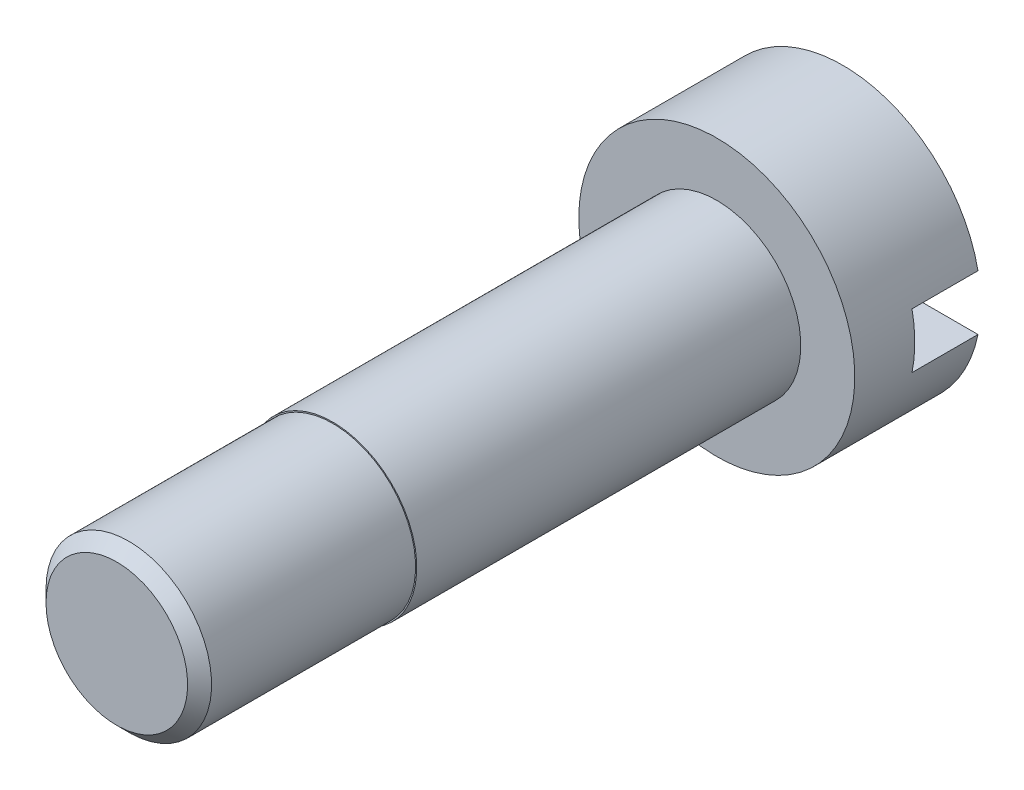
ISO-10303-21;
HEADER;
FILE_DESCRIPTION(('STEP AP214'),'2;1');
FILE_NAME('part.step','',(''),(''),'','','');
FILE_SCHEMA(('AUTOMOTIVE_DESIGN { 1 0 10303 214 1 1 1 1 }'));
ENDSEC;
DATA;
#1=APPLICATION_CONTEXT('core data for automotive mechanical design processes');
#2=APPLICATION_PROTOCOL_DEFINITION('international standard','automotive_design',2000,#1);
#3=PRODUCT_CONTEXT('',#1,'mechanical');
#4=PRODUCT('Part','Part','',(#3));
#5=PRODUCT_RELATED_PRODUCT_CATEGORY('part','',(#4));
#6=PRODUCT_DEFINITION_FORMATION('','',#4);
#7=PRODUCT_DEFINITION_CONTEXT('part definition',#1,'design');
#8=PRODUCT_DEFINITION('design','',#6,#7);
#9=PRODUCT_DEFINITION_SHAPE('','',#8);
#10=(LENGTH_UNIT() NAMED_UNIT(*) SI_UNIT(.MILLI.,.METRE.));
#11=(NAMED_UNIT(*) PLANE_ANGLE_UNIT() SI_UNIT($,.RADIAN.));
#12=(NAMED_UNIT(*) SI_UNIT($,.STERADIAN.) SOLID_ANGLE_UNIT());
#13=UNCERTAINTY_MEASURE_WITH_UNIT(LENGTH_MEASURE(1.E-05),#10,'distance_accuracy_value','');
#14=(GEOMETRIC_REPRESENTATION_CONTEXT(3) GLOBAL_UNCERTAINTY_ASSIGNED_CONTEXT((#13)) GLOBAL_UNIT_ASSIGNED_CONTEXT((#10,
#11,#12)) REPRESENTATION_CONTEXT('',''));
#15=CARTESIAN_POINT('',(0.,0.,0.));
#16=DIRECTION('',(0.,0.,1.));
#17=DIRECTION('',(1.,0.,0.));
#18=AXIS2_PLACEMENT_3D('',#15,#16,#17);
#19=CARTESIAN_POINT('',(0.,0.,0.));
#20=DIRECTION('',(0.,0.,-1.));
#21=DIRECTION('',(-1.,0.,0.));
#22=AXIS2_PLACEMENT_3D('',#19,#20,#21);
#23=PLANE('',#22);
#24=DIRECTION('',(1.,0.,0.));
#25=VECTOR('',#24,1.);
#26=CARTESIAN_POINT('',(-3.81,-0.5842,0.));
#27=LINE('',#26,#25);
#28=CARTESIAN_POINT('',(-2.86198381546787,-0.5842,0.));
#29=VERTEX_POINT('',#28);
#30=CARTESIAN_POINT('',(2.86198381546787,-0.5842,0.));
#31=VERTEX_POINT('',#30);
#32=EDGE_CURVE('E106',#29,#31,#27,.T.);
#33=ORIENTED_EDGE('',*,*,#32,.T.);
#34=CARTESIAN_POINT('',(0.,0.,0.));
#35=DIRECTION('',(0.,0.,-1.));
#36=DIRECTION('',(-1.,0.,0.));
#37=AXIS2_PLACEMENT_3D('',#34,#35,#36);
#38=CIRCLE('',#37,2.921);
#39=EDGE_CURVE('E91',#31,#29,#38,.T.);
#40=ORIENTED_EDGE('',*,*,#39,.T.);
#41=EDGE_LOOP('',(#33,#40));
#42=FACE_BOUND('',#41,.T.);
#43=ADVANCED_FACE('F35',(#42),#23,.T.);
#44=DIRECTION('',(1.,0.,0.));
#45=VECTOR('',#44,1.);
#46=CARTESIAN_POINT('',(-3.81,0.5842,0.));
#47=LINE('',#46,#45);
#48=CARTESIAN_POINT('',(-2.86198381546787,0.5842,0.));
#49=VERTEX_POINT('',#48);
#50=CARTESIAN_POINT('',(2.86198381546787,0.5842,0.));
#51=VERTEX_POINT('',#50);
#52=EDGE_CURVE('E76',#49,#51,#47,.T.);
#53=ORIENTED_EDGE('',*,*,#52,.F.);
#54=EDGE_CURVE('E82',#49,#51,#38,.T.);
#55=ORIENTED_EDGE('',*,*,#54,.T.);
#56=EDGE_LOOP('',(#53,#55));
#57=FACE_BOUND('',#56,.T.);
#58=ADVANCED_FACE('F37',(#57),#23,.T.);
#59=CARTESIAN_POINT('',(0.,0.,0.));
#60=DIRECTION('',(0.,0.,-1.));
#61=DIRECTION('',(-1.,0.,0.));
#62=AXIS2_PLACEMENT_3D('',#59,#60,#61);
#63=CYLINDRICAL_SURFACE('',#62,2.921);
#64=DIRECTION('',(0.,0.,-1.));
#65=VECTOR('',#64,1.);
#66=CARTESIAN_POINT('',(2.86198381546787,-0.5842,0.));
#67=LINE('',#66,#65);
#68=CARTESIAN_POINT('',(2.86198381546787,-0.5842,1.397));
#69=VERTEX_POINT('',#68);
#70=EDGE_CURVE('E11',#69,#31,#67,.T.);
#71=ORIENTED_EDGE('',*,*,#70,.F.);
#72=CARTESIAN_POINT('',(0.,0.,1.397));
#73=DIRECTION('',(0.,0.,1.));
#74=DIRECTION('',(1.,0.,0.));
#75=AXIS2_PLACEMENT_3D('',#72,#73,#74);
#76=CIRCLE('',#75,2.921);
#77=CARTESIAN_POINT('',(2.86198381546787,0.5842,1.397));
#78=VERTEX_POINT('',#77);
#79=EDGE_CURVE('E43',#78,#69,#76,.F.);
#80=ORIENTED_EDGE('',*,*,#79,.F.);
#81=DIRECTION('',(0.,0.,-1.));
#82=VECTOR('',#81,1.);
#83=CARTESIAN_POINT('',(2.86198381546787,0.5842,0.));
#84=LINE('',#83,#82);
#85=EDGE_CURVE('E90',#51,#78,#84,.F.);
#86=ORIENTED_EDGE('',*,*,#85,.F.);
#87=ORIENTED_EDGE('',*,*,#54,.F.);
#88=DIRECTION('',(0.,0.,-1.));
#89=VECTOR('',#88,1.);
#90=CARTESIAN_POINT('',(-2.86198381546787,0.5842,0.));
#91=LINE('',#90,#89);
#92=CARTESIAN_POINT('',(-2.86198381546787,0.5842,1.397));
#93=VERTEX_POINT('',#92);
#94=EDGE_CURVE('E73',#93,#49,#91,.T.);
#95=ORIENTED_EDGE('',*,*,#94,.F.);
#96=CARTESIAN_POINT('',(-2.86198381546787,-0.5842,1.397));
#97=VERTEX_POINT('',#96);
#98=EDGE_CURVE('E81',#97,#93,#76,.F.);
#99=ORIENTED_EDGE('',*,*,#98,.F.);
#100=DIRECTION('',(0.,0.,-1.));
#101=VECTOR('',#100,1.);
#102=CARTESIAN_POINT('',(-2.86198381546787,-0.5842,0.));
#103=LINE('',#102,#101);
#104=EDGE_CURVE('E99',#29,#97,#103,.F.);
#105=ORIENTED_EDGE('',*,*,#104,.F.);
#106=ORIENTED_EDGE('',*,*,#39,.F.);
#107=EDGE_LOOP('',(#71,#80,#86,#87,#95,#99,#105,#106));
#108=FACE_BOUND('',#107,.T.);
#109=CARTESIAN_POINT('',(0.,0.,2.667));
#110=DIRECTION('',(0.,0.,-1.));
#111=DIRECTION('',(-1.,0.,0.));
#112=AXIS2_PLACEMENT_3D('',#109,#110,#111);
#113=CIRCLE('',#112,2.921);
#114=CARTESIAN_POINT('',(-2.921,0.,2.667));
#115=VERTEX_POINT('',#114);
#116=EDGE_CURVE('E94',#115,#115,#113,.T.);
#117=ORIENTED_EDGE('',*,*,#116,.T.);
#118=EDGE_LOOP('',(#117));
#119=FACE_BOUND('',#118,.T.);
#120=ADVANCED_FACE('F87',(#108,#119),#63,.T.);
#121=CARTESIAN_POINT('',(0.,2.921,2.667));
#122=DIRECTION('',(0.,0.,1.));
#123=DIRECTION('',(1.,0.,0.));
#124=AXIS2_PLACEMENT_3D('',#121,#122,#123);
#125=PLANE('',#124);
#126=CARTESIAN_POINT('',(0.,0.,2.667));
#127=DIRECTION('',(0.,0.,-1.));
#128=DIRECTION('',(-1.,0.,0.));
#129=AXIS2_PLACEMENT_3D('',#126,#127,#128);
#130=CIRCLE('',#129,1.778);
#131=CARTESIAN_POINT('',(-1.778,0.,2.667));
#132=VERTEX_POINT('',#131);
#133=EDGE_CURVE('E124',#132,#132,#130,.T.);
#134=ORIENTED_EDGE('',*,*,#133,.T.);
#135=EDGE_LOOP('',(#134));
#136=FACE_BOUND('',#135,.T.);
#137=ORIENTED_EDGE('',*,*,#116,.F.);
#138=EDGE_LOOP('',(#137));
#139=FACE_BOUND('',#138,.T.);
#140=ADVANCED_FACE('F131',(#136,#139),#125,.T.);
#141=CARTESIAN_POINT('',(0.,0.,0.));
#142=DIRECTION('',(0.,0.,-1.));
#143=DIRECTION('',(-1.,0.,0.));
#144=AXIS2_PLACEMENT_3D('',#141,#142,#143);
#145=CYLINDRICAL_SURFACE('',#144,1.778);
#146=CARTESIAN_POINT('',(0.,0.,10.795));
#147=DIRECTION('',(0.,0.,-1.));
#148=DIRECTION('',(-1.,0.,0.));
#149=AXIS2_PLACEMENT_3D('',#146,#147,#148);
#150=CIRCLE('',#149,1.778);
#151=CARTESIAN_POINT('',(-1.778,0.,10.795));
#152=VERTEX_POINT('',#151);
#153=EDGE_CURVE('E122',#152,#152,#150,.T.);
#154=ORIENTED_EDGE('',*,*,#153,.T.);
#155=EDGE_LOOP('',(#154));
#156=FACE_BOUND('',#155,.T.);
#157=ORIENTED_EDGE('',*,*,#133,.F.);
#158=EDGE_LOOP('',(#157));
#159=FACE_BOUND('',#158,.T.);
#160=ADVANCED_FACE('F133',(#156,#159),#145,.T.);
#161=CARTESIAN_POINT('',(0.,1.778,10.795));
#162=DIRECTION('',(0.,0.,1.));
#163=DIRECTION('',(1.,0.,0.));
#164=AXIS2_PLACEMENT_3D('',#161,#162,#163);
#165=PLANE('',#164);
#166=CARTESIAN_POINT('',(0.,0.,10.795));
#167=DIRECTION('',(0.,0.,-1.));
#168=DIRECTION('',(-1.,0.,0.));
#169=AXIS2_PLACEMENT_3D('',#166,#167,#168);
#170=CIRCLE('',#169,1.7526);
#171=CARTESIAN_POINT('',(-1.7526,0.,10.795));
#172=VERTEX_POINT('',#171);
#173=EDGE_CURVE('E119',#172,#172,#170,.T.);
#174=ORIENTED_EDGE('',*,*,#173,.T.);
#175=EDGE_LOOP('',(#174));
#176=FACE_BOUND('',#175,.T.);
#177=ORIENTED_EDGE('',*,*,#153,.F.);
#178=EDGE_LOOP('',(#177));
#179=FACE_BOUND('',#178,.T.);
#180=ADVANCED_FACE('F139',(#176,#179),#165,.T.);
#181=CARTESIAN_POINT('',(0.,0.,0.));
#182=DIRECTION('',(0.,0.,-1.));
#183=DIRECTION('',(-1.,0.,0.));
#184=AXIS2_PLACEMENT_3D('',#181,#182,#183);
#185=CYLINDRICAL_SURFACE('',#184,1.7526);
#186=CARTESIAN_POINT('',(0.,0.,15.113));
#187=DIRECTION('',(0.,0.,-1.));
#188=DIRECTION('',(-1.,0.,0.));
#189=AXIS2_PLACEMENT_3D('',#186,#187,#188);
#190=CIRCLE('',#189,1.7526);
#191=CARTESIAN_POINT('',(-1.7526,0.,15.113));
#192=VERTEX_POINT('',#191);
#193=EDGE_CURVE('E113',#192,#192,#190,.T.);
#194=ORIENTED_EDGE('',*,*,#193,.T.);
#195=EDGE_LOOP('',(#194));
#196=FACE_BOUND('',#195,.T.);
#197=ORIENTED_EDGE('',*,*,#173,.F.);
#198=EDGE_LOOP('',(#197));
#199=FACE_BOUND('',#198,.T.);
#200=ADVANCED_FACE('F190',(#196,#199),#185,.T.);
#201=CARTESIAN_POINT('',(0.,0.,15.113));
#202=DIRECTION('',(0.,0.,-1.));
#203=DIRECTION('',(-1.,0.,0.));
#204=AXIS2_PLACEMENT_3D('',#201,#202,#203);
#205=CONICAL_SURFACE('',#204,1.7526,0.785398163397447);
#206=CARTESIAN_POINT('',(0.,0.,15.367));
#207=DIRECTION('',(0.,0.,-1.));
#208=DIRECTION('',(-1.,0.,0.));
#209=AXIS2_PLACEMENT_3D('',#206,#207,#208);
#210=CIRCLE('',#209,1.4986);
#211=CARTESIAN_POINT('',(-1.4986,0.,15.367));
#212=VERTEX_POINT('',#211);
#213=EDGE_CURVE('E110',#212,#212,#210,.T.);
#214=ORIENTED_EDGE('',*,*,#213,.T.);
#215=EDGE_LOOP('',(#214));
#216=FACE_BOUND('',#215,.T.);
#217=ORIENTED_EDGE('',*,*,#193,.F.);
#218=EDGE_LOOP('',(#217));
#219=FACE_BOUND('',#218,.T.);
#220=ADVANCED_FACE('F186',(#216,#219),#205,.T.);
#221=CARTESIAN_POINT('',(0.,1.4986,15.367));
#222=DIRECTION('',(0.,0.,1.));
#223=DIRECTION('',(1.,0.,0.));
#224=AXIS2_PLACEMENT_3D('',#221,#222,#223);
#225=PLANE('',#224);
#226=ORIENTED_EDGE('',*,*,#213,.F.);
#227=EDGE_LOOP('',(#226));
#228=FACE_BOUND('',#227,.T.);
#229=ADVANCED_FACE('F162',(#228),#225,.T.);
#230=CARTESIAN_POINT('',(-3.81,-0.5842,0.));
#231=DIRECTION('',(0.,-1.,0.));
#232=DIRECTION('',(0.,0.,-1.));
#233=AXIS2_PLACEMENT_3D('',#230,#231,#232);
#234=PLANE('',#233);
#235=ORIENTED_EDGE('',*,*,#104,.T.);
#236=DIRECTION('',(1.,0.,0.));
#237=VECTOR('',#236,1.);
#238=CARTESIAN_POINT('',(-3.81,-0.5842,1.397));
#239=LINE('',#238,#237);
#240=EDGE_CURVE('E103',#97,#69,#239,.T.);
#241=ORIENTED_EDGE('',*,*,#240,.T.);
#242=ORIENTED_EDGE('',*,*,#70,.T.);
#243=ORIENTED_EDGE('',*,*,#32,.F.);
#244=EDGE_LOOP('',(#235,#241,#242,#243));
#245=FACE_BOUND('',#244,.T.);
#246=ADVANCED_FACE('F104',(#245),#234,.F.);
#247=CARTESIAN_POINT('',(-3.81,0.5842,1.397));
#248=DIRECTION('',(0.,0.,1.));
#249=DIRECTION('',(1.,0.,0.));
#250=AXIS2_PLACEMENT_3D('',#247,#248,#249);
#251=PLANE('',#250);
#252=ORIENTED_EDGE('',*,*,#98,.T.);
#253=DIRECTION('',(1.,0.,0.));
#254=VECTOR('',#253,1.);
#255=CARTESIAN_POINT('',(-3.81,0.5842,1.397));
#256=LINE('',#255,#254);
#257=EDGE_CURVE('E50',#93,#78,#256,.T.);
#258=ORIENTED_EDGE('',*,*,#257,.T.);
#259=ORIENTED_EDGE('',*,*,#79,.T.);
#260=ORIENTED_EDGE('',*,*,#240,.F.);
#261=EDGE_LOOP('',(#252,#258,#259,#260));
#262=FACE_BOUND('',#261,.T.);
#263=ADVANCED_FACE('F102',(#262),#251,.F.);
#264=CARTESIAN_POINT('',(-3.81,0.5842,0.));
#265=DIRECTION('',(0.,1.,0.));
#266=DIRECTION('',(0.,0.,1.));
#267=AXIS2_PLACEMENT_3D('',#264,#265,#266);
#268=PLANE('',#267);
#269=ORIENTED_EDGE('',*,*,#85,.T.);
#270=ORIENTED_EDGE('',*,*,#257,.F.);
#271=ORIENTED_EDGE('',*,*,#94,.T.);
#272=ORIENTED_EDGE('',*,*,#52,.T.);
#273=EDGE_LOOP('',(#269,#270,#271,#272));
#274=FACE_BOUND('',#273,.T.);
#275=ADVANCED_FACE('F75',(#274),#268,.F.);
#276=CLOSED_SHELL('',(#43,#58,#120,#140,#160,#180,#200,#220,#229,#246,#263,#275));
#277=MANIFOLD_SOLID_BREP('B2',#276);
#278=ADVANCED_BREP_SHAPE_REPRESENTATION('',(#18,#277),#14);
#279=SHAPE_DEFINITION_REPRESENTATION(#9,#278);
ENDSEC;
END-ISO-10303-21;
